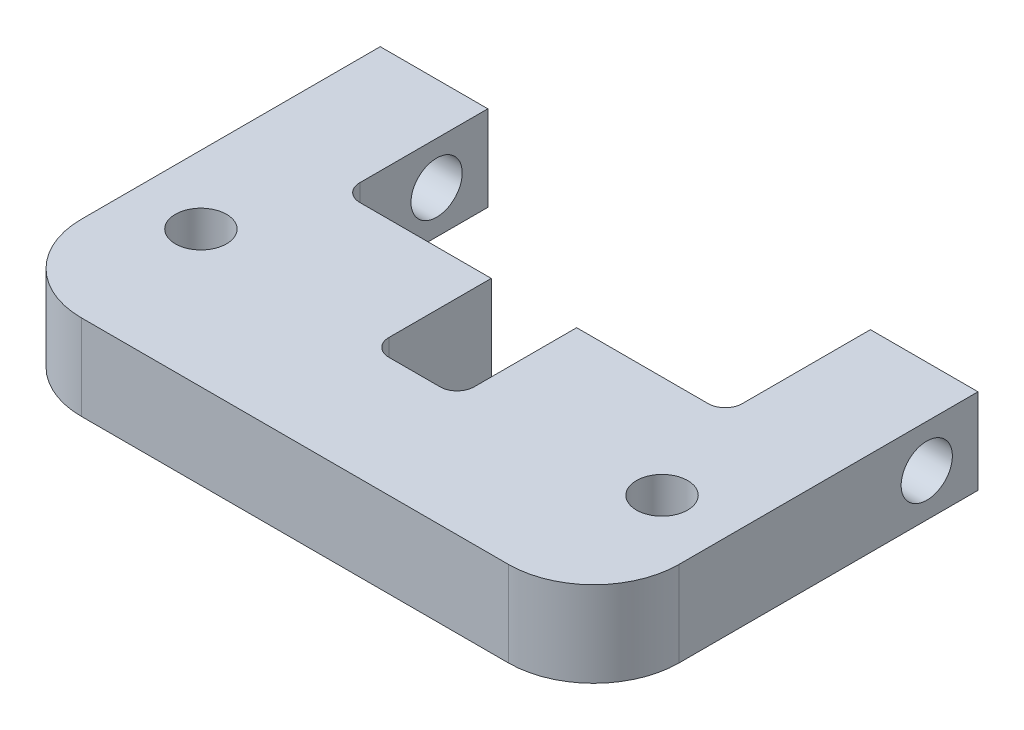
ISO-10303-21;
HEADER;
FILE_DESCRIPTION(('STEP AP214'),'2;1');
FILE_NAME('part.step','',(''),(''),'','','');
FILE_SCHEMA(('AUTOMOTIVE_DESIGN { 1 0 10303 214 1 1 1 1 }'));
ENDSEC;
DATA;
#1=APPLICATION_CONTEXT('core data for automotive mechanical design processes');
#2=APPLICATION_PROTOCOL_DEFINITION('international standard','automotive_design',2000,#1);
#3=PRODUCT_CONTEXT('',#1,'mechanical');
#4=PRODUCT('Part','Part','',(#3));
#5=PRODUCT_RELATED_PRODUCT_CATEGORY('part','',(#4));
#6=PRODUCT_DEFINITION_FORMATION('','',#4);
#7=PRODUCT_DEFINITION_CONTEXT('part definition',#1,'design');
#8=PRODUCT_DEFINITION('design','',#6,#7);
#9=PRODUCT_DEFINITION_SHAPE('','',#8);
#10=(LENGTH_UNIT() NAMED_UNIT(*) SI_UNIT(.MILLI.,.METRE.));
#11=(NAMED_UNIT(*) PLANE_ANGLE_UNIT() SI_UNIT($,.RADIAN.));
#12=(NAMED_UNIT(*) SI_UNIT($,.STERADIAN.) SOLID_ANGLE_UNIT());
#13=UNCERTAINTY_MEASURE_WITH_UNIT(LENGTH_MEASURE(1.E-05),#10,'distance_accuracy_value','');
#14=(GEOMETRIC_REPRESENTATION_CONTEXT(3) GLOBAL_UNCERTAINTY_ASSIGNED_CONTEXT((#13)) GLOBAL_UNIT_ASSIGNED_CONTEXT((#10,
#11,#12)) REPRESENTATION_CONTEXT('',''));
#15=CARTESIAN_POINT('',(0.,0.,0.));
#16=DIRECTION('',(0.,0.,1.));
#17=DIRECTION('',(1.,0.,0.));
#18=AXIS2_PLACEMENT_3D('',#15,#16,#17);
#19=CARTESIAN_POINT('',(10.2,5.,7.49999999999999));
#20=DIRECTION('',(0.,-1.,0.));
#21=DIRECTION('',(0.,0.,-1.));
#22=AXIS2_PLACEMENT_3D('',#19,#20,#21);
#23=PLANE('',#22);
#24=CARTESIAN_POINT('',(13.5,5.,14.5));
#25=DIRECTION('',(0.,1.,0.));
#26=DIRECTION('',(0.,0.,1.));
#27=AXIS2_PLACEMENT_3D('',#24,#25,#26);
#28=CIRCLE('',#27,1.5);
#29=CARTESIAN_POINT('',(13.5,5.,16.));
#30=VERTEX_POINT('',#29);
#31=EDGE_CURVE('E215',#30,#30,#28,.T.);
#32=ORIENTED_EDGE('',*,*,#31,.F.);
#33=EDGE_LOOP('',(#32));
#34=FACE_BOUND('',#33,.T.);
#35=DIRECTION('',(1.,0.,0.));
#36=VECTOR('',#35,1.);
#37=CARTESIAN_POINT('',(-17.5,5.,22.5));
#38=LINE('',#37,#36);
#39=CARTESIAN_POINT('',(-12.5,5.,22.5));
#40=VERTEX_POINT('',#39);
#41=CARTESIAN_POINT('',(12.5,5.,22.5));
#42=VERTEX_POINT('',#41);
#43=EDGE_CURVE('E169',#40,#42,#38,.T.);
#44=ORIENTED_EDGE('',*,*,#43,.T.);
#45=CARTESIAN_POINT('',(12.5,5.,17.5));
#46=DIRECTION('',(0.,-1.,0.));
#47=DIRECTION('',(0.,0.,-1.));
#48=AXIS2_PLACEMENT_3D('',#45,#46,#47);
#49=CIRCLE('',#48,5.);
#50=CARTESIAN_POINT('',(17.5,5.,17.5));
#51=VERTEX_POINT('',#50);
#52=EDGE_CURVE('E41',#42,#51,#49,.F.);
#53=ORIENTED_EDGE('',*,*,#52,.T.);
#54=DIRECTION('',(0.,0.,-1.));
#55=VECTOR('',#54,1.);
#56=CARTESIAN_POINT('',(17.5,5.,0.));
#57=LINE('',#56,#55);
#58=CARTESIAN_POINT('',(17.5,5.,0.));
#59=VERTEX_POINT('',#58);
#60=EDGE_CURVE('E159',#51,#59,#57,.T.);
#61=ORIENTED_EDGE('',*,*,#60,.T.);
#62=DIRECTION('',(-1.,0.,0.));
#63=VECTOR('',#62,1.);
#64=CARTESIAN_POINT('',(11.2,5.,0.));
#65=LINE('',#64,#63);
#66=CARTESIAN_POINT('',(11.2,5.,0.));
#67=VERTEX_POINT('',#66);
#68=EDGE_CURVE('E163',#59,#67,#65,.T.);
#69=ORIENTED_EDGE('',*,*,#68,.T.);
#70=DIRECTION('',(0.,0.,1.));
#71=VECTOR('',#70,1.);
#72=CARTESIAN_POINT('',(11.2,5.,0.));
#73=LINE('',#72,#71);
#74=CARTESIAN_POINT('',(11.2,5.,7.49999999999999));
#75=VERTEX_POINT('',#74);
#76=EDGE_CURVE('E184',#67,#75,#73,.T.);
#77=ORIENTED_EDGE('',*,*,#76,.T.);
#78=CARTESIAN_POINT('',(10.2,5.,7.49999999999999));
#79=DIRECTION('',(0.,-1.,0.));
#80=DIRECTION('',(0.,0.,-1.));
#81=AXIS2_PLACEMENT_3D('',#78,#79,#80);
#82=CIRCLE('',#81,0.999999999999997);
#83=CARTESIAN_POINT('',(10.2,5.,8.5));
#84=VERTEX_POINT('',#83);
#85=EDGE_CURVE('E186',#75,#84,#82,.T.);
#86=ORIENTED_EDGE('',*,*,#85,.T.);
#87=DIRECTION('',(-1.,0.,0.));
#88=VECTOR('',#87,1.);
#89=CARTESIAN_POINT('',(2.5,5.,8.5));
#90=LINE('',#89,#88);
#91=CARTESIAN_POINT('',(2.5,5.,8.5));
#92=VERTEX_POINT('',#91);
#93=EDGE_CURVE('E191',#84,#92,#90,.T.);
#94=ORIENTED_EDGE('',*,*,#93,.T.);
#95=DIRECTION('',(0.,0.,1.));
#96=VECTOR('',#95,1.);
#97=CARTESIAN_POINT('',(2.5,5.,8.5));
#98=LINE('',#97,#96);
#99=CARTESIAN_POINT('',(2.50000000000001,5.,14.5));
#100=VERTEX_POINT('',#99);
#101=EDGE_CURVE('E193',#92,#100,#98,.T.);
#102=ORIENTED_EDGE('',*,*,#101,.T.);
#103=CARTESIAN_POINT('',(1.50000000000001,5.,14.5));
#104=DIRECTION('',(0.,-1.,0.));
#105=DIRECTION('',(0.,0.,-1.));
#106=AXIS2_PLACEMENT_3D('',#103,#104,#105);
#107=CIRCLE('',#106,0.999999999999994);
#108=CARTESIAN_POINT('',(1.50000000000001,5.,15.5));
#109=VERTEX_POINT('',#108);
#110=EDGE_CURVE('E195',#100,#109,#107,.T.);
#111=ORIENTED_EDGE('',*,*,#110,.T.);
#112=DIRECTION('',(-1.,0.,0.));
#113=VECTOR('',#112,1.);
#114=CARTESIAN_POINT('',(-1.5,5.,15.5));
#115=LINE('',#114,#113);
#116=CARTESIAN_POINT('',(-1.5,5.,15.5));
#117=VERTEX_POINT('',#116);
#118=EDGE_CURVE('E197',#109,#117,#115,.T.);
#119=ORIENTED_EDGE('',*,*,#118,.T.);
#120=CARTESIAN_POINT('',(-1.5,5.,14.5));
#121=DIRECTION('',(0.,-1.,0.));
#122=DIRECTION('',(0.,0.,1.));
#123=AXIS2_PLACEMENT_3D('',#120,#121,#122);
#124=CIRCLE('',#123,0.999999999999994);
#125=CARTESIAN_POINT('',(-2.49999999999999,5.,14.5));
#126=VERTEX_POINT('',#125);
#127=EDGE_CURVE('E199',#117,#126,#124,.T.);
#128=ORIENTED_EDGE('',*,*,#127,.T.);
#129=DIRECTION('',(0.,0.,-1.));
#130=VECTOR('',#129,1.);
#131=CARTESIAN_POINT('',(-2.49999999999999,5.,8.5));
#132=LINE('',#131,#130);
#133=CARTESIAN_POINT('',(-2.49999999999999,5.,8.5));
#134=VERTEX_POINT('',#133);
#135=EDGE_CURVE('E201',#126,#134,#132,.T.);
#136=ORIENTED_EDGE('',*,*,#135,.T.);
#137=DIRECTION('',(-1.,0.,0.));
#138=VECTOR('',#137,1.);
#139=CARTESIAN_POINT('',(-10.2,5.,8.5));
#140=LINE('',#139,#138);
#141=CARTESIAN_POINT('',(-10.2,5.,8.49999999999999));
#142=VERTEX_POINT('',#141);
#143=EDGE_CURVE('E203',#134,#142,#140,.T.);
#144=ORIENTED_EDGE('',*,*,#143,.T.);
#145=CARTESIAN_POINT('',(-10.2,5.,7.5));
#146=DIRECTION('',(0.,-1.,0.));
#147=DIRECTION('',(0.,0.,1.));
#148=AXIS2_PLACEMENT_3D('',#145,#146,#147);
#149=CIRCLE('',#148,0.999999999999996);
#150=CARTESIAN_POINT('',(-11.2,5.,7.5));
#151=VERTEX_POINT('',#150);
#152=EDGE_CURVE('E205',#142,#151,#149,.T.);
#153=ORIENTED_EDGE('',*,*,#152,.T.);
#154=DIRECTION('',(0.,0.,-1.));
#155=VECTOR('',#154,1.);
#156=CARTESIAN_POINT('',(-11.2,5.,0.));
#157=LINE('',#156,#155);
#158=CARTESIAN_POINT('',(-11.2,5.,0.));
#159=VERTEX_POINT('',#158);
#160=EDGE_CURVE('E207',#151,#159,#157,.T.);
#161=ORIENTED_EDGE('',*,*,#160,.T.);
#162=DIRECTION('',(-1.,0.,0.));
#163=VECTOR('',#162,1.);
#164=CARTESIAN_POINT('',(-17.5,5.,0.));
#165=LINE('',#164,#163);
#166=CARTESIAN_POINT('',(-17.5,5.,0.));
#167=VERTEX_POINT('',#166);
#168=EDGE_CURVE('E209',#159,#167,#165,.T.);
#169=ORIENTED_EDGE('',*,*,#168,.T.);
#170=DIRECTION('',(0.,0.,1.));
#171=VECTOR('',#170,1.);
#172=CARTESIAN_POINT('',(-17.5,5.,0.));
#173=LINE('',#172,#171);
#174=CARTESIAN_POINT('',(-17.5,5.,17.5));
#175=VERTEX_POINT('',#174);
#176=EDGE_CURVE('E244',#167,#175,#173,.T.);
#177=ORIENTED_EDGE('',*,*,#176,.T.);
#178=CARTESIAN_POINT('',(-12.5,5.,17.5));
#179=DIRECTION('',(0.,-1.,0.));
#180=DIRECTION('',(0.,0.,-1.));
#181=AXIS2_PLACEMENT_3D('',#178,#179,#180);
#182=CIRCLE('',#181,5.);
#183=EDGE_CURVE('E295',#175,#40,#182,.F.);
#184=ORIENTED_EDGE('',*,*,#183,.T.);
#185=EDGE_LOOP('',(#44,#53,#61,#69,#77,#86,#94,#102,#111,#119,#128,#136,#144,#153,#161,#169,
#177,#184));
#186=FACE_BOUND('',#185,.T.);
#187=CARTESIAN_POINT('',(-13.5,5.,14.5));
#188=DIRECTION('',(0.,1.,0.));
#189=DIRECTION('',(0.,0.,-1.));
#190=AXIS2_PLACEMENT_3D('',#187,#188,#189);
#191=CIRCLE('',#190,1.5);
#192=CARTESIAN_POINT('',(-13.5,5.,13.));
#193=VERTEX_POINT('',#192);
#194=EDGE_CURVE('E585',#193,#193,#191,.T.);
#195=ORIENTED_EDGE('',*,*,#194,.F.);
#196=EDGE_LOOP('',(#195));
#197=FACE_BOUND('',#196,.T.);
#198=ADVANCED_FACE('F33',(#34,#186,#197),#23,.F.);
#199=CARTESIAN_POINT('',(10.2,0.,7.49999999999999));
#200=DIRECTION('',(0.,-1.,0.));
#201=DIRECTION('',(0.,0.,-1.));
#202=AXIS2_PLACEMENT_3D('',#199,#200,#201);
#203=PLANE('',#202);
#204=CARTESIAN_POINT('',(13.5,0.,14.5));
#205=DIRECTION('',(0.,1.,0.));
#206=DIRECTION('',(0.,0.,1.));
#207=AXIS2_PLACEMENT_3D('',#204,#205,#206);
#208=CIRCLE('',#207,1.5);
#209=CARTESIAN_POINT('',(13.5,0.,16.));
#210=VERTEX_POINT('',#209);
#211=EDGE_CURVE('E588',#210,#210,#208,.T.);
#212=ORIENTED_EDGE('',*,*,#211,.T.);
#213=EDGE_LOOP('',(#212));
#214=FACE_BOUND('',#213,.T.);
#215=DIRECTION('',(0.,0.,-1.));
#216=VECTOR('',#215,1.);
#217=CARTESIAN_POINT('',(17.5,0.,0.));
#218=LINE('',#217,#216);
#219=CARTESIAN_POINT('',(17.5,0.,17.5));
#220=VERTEX_POINT('',#219);
#221=CARTESIAN_POINT('',(17.5,0.,0.));
#222=VERTEX_POINT('',#221);
#223=EDGE_CURVE('E175',#220,#222,#218,.T.);
#224=ORIENTED_EDGE('',*,*,#223,.F.);
#225=CARTESIAN_POINT('',(12.5,0.,17.5));
#226=DIRECTION('',(0.,-1.,0.));
#227=DIRECTION('',(0.,0.,-1.));
#228=AXIS2_PLACEMENT_3D('',#225,#226,#227);
#229=CIRCLE('',#228,5.);
#230=CARTESIAN_POINT('',(12.5,0.,22.5));
#231=VERTEX_POINT('',#230);
#232=EDGE_CURVE('E289',#220,#231,#229,.T.);
#233=ORIENTED_EDGE('',*,*,#232,.T.);
#234=DIRECTION('',(1.,0.,0.));
#235=VECTOR('',#234,1.);
#236=CARTESIAN_POINT('',(6.00000000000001,0.,22.5));
#237=LINE('',#236,#235);
#238=CARTESIAN_POINT('',(-12.5,0.,22.5));
#239=VERTEX_POINT('',#238);
#240=EDGE_CURVE('E214',#239,#231,#237,.T.);
#241=ORIENTED_EDGE('',*,*,#240,.F.);
#242=CARTESIAN_POINT('',(-12.5,0.,17.5));
#243=DIRECTION('',(0.,-1.,0.));
#244=DIRECTION('',(0.,0.,-1.));
#245=AXIS2_PLACEMENT_3D('',#242,#243,#244);
#246=CIRCLE('',#245,5.);
#247=CARTESIAN_POINT('',(-17.5,0.,17.5));
#248=VERTEX_POINT('',#247);
#249=EDGE_CURVE('E287',#239,#248,#246,.T.);
#250=ORIENTED_EDGE('',*,*,#249,.T.);
#251=DIRECTION('',(0.,0.,1.));
#252=VECTOR('',#251,1.);
#253=CARTESIAN_POINT('',(-17.5,0.,0.));
#254=LINE('',#253,#252);
#255=CARTESIAN_POINT('',(-17.5,0.,0.));
#256=VERTEX_POINT('',#255);
#257=EDGE_CURVE('E212',#256,#248,#254,.T.);
#258=ORIENTED_EDGE('',*,*,#257,.F.);
#259=DIRECTION('',(-1.,0.,0.));
#260=VECTOR('',#259,1.);
#261=CARTESIAN_POINT('',(-17.5,0.,0.));
#262=LINE('',#261,#260);
#263=CARTESIAN_POINT('',(-11.2,0.,0.));
#264=VERTEX_POINT('',#263);
#265=EDGE_CURVE('E242',#264,#256,#262,.T.);
#266=ORIENTED_EDGE('',*,*,#265,.F.);
#267=DIRECTION('',(0.,0.,-1.));
#268=VECTOR('',#267,1.);
#269=CARTESIAN_POINT('',(-11.2,0.,0.));
#270=LINE('',#269,#268);
#271=CARTESIAN_POINT('',(-11.2,0.,7.5));
#272=VERTEX_POINT('',#271);
#273=EDGE_CURVE('E240',#272,#264,#270,.T.);
#274=ORIENTED_EDGE('',*,*,#273,.F.);
#275=CARTESIAN_POINT('',(-10.2,0.,7.5));
#276=DIRECTION('',(0.,-1.,0.));
#277=DIRECTION('',(0.,0.,1.));
#278=AXIS2_PLACEMENT_3D('',#275,#276,#277);
#279=CIRCLE('',#278,0.999999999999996);
#280=CARTESIAN_POINT('',(-10.2,0.,8.49999999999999));
#281=VERTEX_POINT('',#280);
#282=EDGE_CURVE('E238',#281,#272,#279,.T.);
#283=ORIENTED_EDGE('',*,*,#282,.F.);
#284=DIRECTION('',(-1.,0.,0.));
#285=VECTOR('',#284,1.);
#286=CARTESIAN_POINT('',(-10.2,0.,8.5));
#287=LINE('',#286,#285);
#288=CARTESIAN_POINT('',(-2.49999999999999,0.,8.5));
#289=VERTEX_POINT('',#288);
#290=EDGE_CURVE('E236',#289,#281,#287,.T.);
#291=ORIENTED_EDGE('',*,*,#290,.F.);
#292=DIRECTION('',(0.,0.,-1.));
#293=VECTOR('',#292,1.);
#294=CARTESIAN_POINT('',(-2.49999999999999,0.,8.5));
#295=LINE('',#294,#293);
#296=CARTESIAN_POINT('',(-2.49999999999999,0.,14.5));
#297=VERTEX_POINT('',#296);
#298=EDGE_CURVE('E234',#297,#289,#295,.T.);
#299=ORIENTED_EDGE('',*,*,#298,.F.);
#300=CARTESIAN_POINT('',(-1.5,0.,14.5));
#301=DIRECTION('',(0.,-1.,0.));
#302=DIRECTION('',(0.,0.,1.));
#303=AXIS2_PLACEMENT_3D('',#300,#301,#302);
#304=CIRCLE('',#303,0.999999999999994);
#305=CARTESIAN_POINT('',(-1.5,0.,15.5));
#306=VERTEX_POINT('',#305);
#307=EDGE_CURVE('E232',#306,#297,#304,.T.);
#308=ORIENTED_EDGE('',*,*,#307,.F.);
#309=DIRECTION('',(-1.,0.,0.));
#310=VECTOR('',#309,1.);
#311=CARTESIAN_POINT('',(-1.5,0.,15.5));
#312=LINE('',#311,#310);
#313=CARTESIAN_POINT('',(1.50000000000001,0.,15.5));
#314=VERTEX_POINT('',#313);
#315=EDGE_CURVE('E230',#314,#306,#312,.T.);
#316=ORIENTED_EDGE('',*,*,#315,.F.);
#317=CARTESIAN_POINT('',(1.50000000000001,0.,14.5));
#318=DIRECTION('',(0.,-1.,0.));
#319=DIRECTION('',(0.,0.,-1.));
#320=AXIS2_PLACEMENT_3D('',#317,#318,#319);
#321=CIRCLE('',#320,0.999999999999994);
#322=CARTESIAN_POINT('',(2.50000000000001,0.,14.5));
#323=VERTEX_POINT('',#322);
#324=EDGE_CURVE('E228',#323,#314,#321,.T.);
#325=ORIENTED_EDGE('',*,*,#324,.F.);
#326=DIRECTION('',(0.,0.,1.));
#327=VECTOR('',#326,1.);
#328=CARTESIAN_POINT('',(2.5,0.,8.5));
#329=LINE('',#328,#327);
#330=CARTESIAN_POINT('',(2.5,0.,8.5));
#331=VERTEX_POINT('',#330);
#332=EDGE_CURVE('E226',#331,#323,#329,.T.);
#333=ORIENTED_EDGE('',*,*,#332,.F.);
#334=DIRECTION('',(-1.,0.,0.));
#335=VECTOR('',#334,1.);
#336=CARTESIAN_POINT('',(2.5,0.,8.5));
#337=LINE('',#336,#335);
#338=CARTESIAN_POINT('',(10.2,0.,8.5));
#339=VERTEX_POINT('',#338);
#340=EDGE_CURVE('E224',#339,#331,#337,.T.);
#341=ORIENTED_EDGE('',*,*,#340,.F.);
#342=CARTESIAN_POINT('',(10.2,0.,7.49999999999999));
#343=DIRECTION('',(0.,-1.,0.));
#344=DIRECTION('',(0.,0.,-1.));
#345=AXIS2_PLACEMENT_3D('',#342,#343,#344);
#346=CIRCLE('',#345,0.999999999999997);
#347=CARTESIAN_POINT('',(11.2,0.,7.49999999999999));
#348=VERTEX_POINT('',#347);
#349=EDGE_CURVE('E222',#348,#339,#346,.T.);
#350=ORIENTED_EDGE('',*,*,#349,.F.);
#351=DIRECTION('',(0.,0.,1.));
#352=VECTOR('',#351,1.);
#353=CARTESIAN_POINT('',(11.2,0.,0.));
#354=LINE('',#353,#352);
#355=CARTESIAN_POINT('',(11.2,0.,0.));
#356=VERTEX_POINT('',#355);
#357=EDGE_CURVE('E220',#356,#348,#354,.T.);
#358=ORIENTED_EDGE('',*,*,#357,.F.);
#359=DIRECTION('',(-1.,0.,0.));
#360=VECTOR('',#359,1.);
#361=CARTESIAN_POINT('',(11.2,0.,0.));
#362=LINE('',#361,#360);
#363=EDGE_CURVE('E218',#222,#356,#362,.T.);
#364=ORIENTED_EDGE('',*,*,#363,.F.);
#365=EDGE_LOOP('',(#224,#233,#241,#250,#258,#266,#274,#283,#291,#299,#308,#316,#325,#333,#341,
#350,#358,#364));
#366=FACE_BOUND('',#365,.T.);
#367=CARTESIAN_POINT('',(-13.5,0.,14.5));
#368=DIRECTION('',(0.,1.,0.));
#369=DIRECTION('',(0.,0.,-1.));
#370=AXIS2_PLACEMENT_3D('',#367,#368,#369);
#371=CIRCLE('',#370,1.5);
#372=CARTESIAN_POINT('',(-13.5,0.,13.));
#373=VERTEX_POINT('',#372);
#374=EDGE_CURVE('E584',#373,#373,#371,.T.);
#375=ORIENTED_EDGE('',*,*,#374,.T.);
#376=EDGE_LOOP('',(#375));
#377=FACE_BOUND('',#376,.T.);
#378=ADVANCED_FACE('F303',(#214,#366,#377),#203,.T.);
#379=CARTESIAN_POINT('',(-17.5,5.,0.));
#380=DIRECTION('',(1.,0.,0.));
#381=DIRECTION('',(0.,0.,-1.));
#382=AXIS2_PLACEMENT_3D('',#379,#380,#381);
#383=PLANE('',#382);
#384=CARTESIAN_POINT('',(-17.5,2.5,3.));
#385=DIRECTION('',(1.,0.,0.));
#386=DIRECTION('',(0.,0.,-1.));
#387=AXIS2_PLACEMENT_3D('',#384,#385,#386);
#388=CIRCLE('',#387,1.5);
#389=CARTESIAN_POINT('',(-17.5,2.5,1.5));
#390=VERTEX_POINT('',#389);
#391=EDGE_CURVE('E285',#390,#390,#388,.T.);
#392=ORIENTED_EDGE('',*,*,#391,.T.);
#393=EDGE_LOOP('',(#392));
#394=FACE_BOUND('',#393,.T.);
#395=ORIENTED_EDGE('',*,*,#257,.T.);
#396=DIRECTION('',(0.,-1.,0.));
#397=VECTOR('',#396,1.);
#398=CARTESIAN_POINT('',(-17.5,5.,17.5));
#399=LINE('',#398,#397);
#400=EDGE_CURVE('E11',#248,#175,#399,.F.);
#401=ORIENTED_EDGE('',*,*,#400,.T.);
#402=ORIENTED_EDGE('',*,*,#176,.F.);
#403=DIRECTION('',(0.,-1.,0.));
#404=VECTOR('',#403,1.);
#405=CARTESIAN_POINT('',(-17.5,5.,0.));
#406=LINE('',#405,#404);
#407=EDGE_CURVE('E211',#167,#256,#406,.T.);
#408=ORIENTED_EDGE('',*,*,#407,.T.);
#409=EDGE_LOOP('',(#395,#401,#402,#408));
#410=FACE_BOUND('',#409,.T.);
#411=ADVANCED_FACE('F306',(#394,#410),#383,.F.);
#412=CARTESIAN_POINT('',(6.00000000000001,5.,22.5));
#413=DIRECTION('',(0.,0.,-1.));
#414=DIRECTION('',(-1.,0.,0.));
#415=AXIS2_PLACEMENT_3D('',#412,#413,#414);
#416=PLANE('',#415);
#417=ORIENTED_EDGE('',*,*,#240,.T.);
#418=DIRECTION('',(0.,-1.,0.));
#419=VECTOR('',#418,1.);
#420=CARTESIAN_POINT('',(12.5,5.,22.5));
#421=LINE('',#420,#419);
#422=EDGE_CURVE('E54',#231,#42,#421,.F.);
#423=ORIENTED_EDGE('',*,*,#422,.T.);
#424=ORIENTED_EDGE('',*,*,#43,.F.);
#425=DIRECTION('',(0.,-1.,0.));
#426=VECTOR('',#425,1.);
#427=CARTESIAN_POINT('',(-12.5,5.,22.5));
#428=LINE('',#427,#426);
#429=EDGE_CURVE('E291',#40,#239,#428,.T.);
#430=ORIENTED_EDGE('',*,*,#429,.T.);
#431=EDGE_LOOP('',(#417,#423,#424,#430));
#432=FACE_BOUND('',#431,.T.);
#433=ADVANCED_FACE('F299',(#432),#416,.F.);
#434=CARTESIAN_POINT('',(17.5,5.,0.));
#435=DIRECTION('',(-1.,0.,0.));
#436=DIRECTION('',(0.,0.,1.));
#437=AXIS2_PLACEMENT_3D('',#434,#435,#436);
#438=PLANE('',#437);
#439=CARTESIAN_POINT('',(17.5,2.5,3.));
#440=DIRECTION('',(1.,0.,0.));
#441=DIRECTION('',(0.,0.,-1.));
#442=AXIS2_PLACEMENT_3D('',#439,#440,#441);
#443=CIRCLE('',#442,1.5);
#444=CARTESIAN_POINT('',(17.5,2.5,1.5));
#445=VERTEX_POINT('',#444);
#446=EDGE_CURVE('E578',#445,#445,#443,.T.);
#447=ORIENTED_EDGE('',*,*,#446,.F.);
#448=EDGE_LOOP('',(#447));
#449=FACE_BOUND('',#448,.T.);
#450=ORIENTED_EDGE('',*,*,#60,.F.);
#451=DIRECTION('',(0.,-1.,0.));
#452=VECTOR('',#451,1.);
#453=CARTESIAN_POINT('',(17.5,5.,17.5));
#454=LINE('',#453,#452);
#455=EDGE_CURVE('E178',#51,#220,#454,.T.);
#456=ORIENTED_EDGE('',*,*,#455,.T.);
#457=ORIENTED_EDGE('',*,*,#223,.T.);
#458=DIRECTION('',(0.,-1.,0.));
#459=VECTOR('',#458,1.);
#460=CARTESIAN_POINT('',(17.5,5.,0.));
#461=LINE('',#460,#459);
#462=EDGE_CURVE('E172',#59,#222,#461,.T.);
#463=ORIENTED_EDGE('',*,*,#462,.F.);
#464=EDGE_LOOP('',(#450,#456,#457,#463));
#465=FACE_BOUND('',#464,.T.);
#466=ADVANCED_FACE('F173',(#449,#465),#438,.F.);
#467=CARTESIAN_POINT('',(11.2,5.,0.));
#468=DIRECTION('',(0.,0.,1.));
#469=DIRECTION('',(1.,0.,0.));
#470=AXIS2_PLACEMENT_3D('',#467,#468,#469);
#471=PLANE('',#470);
#472=ORIENTED_EDGE('',*,*,#363,.T.);
#473=DIRECTION('',(0.,-1.,0.));
#474=VECTOR('',#473,1.);
#475=CARTESIAN_POINT('',(11.2,5.,0.));
#476=LINE('',#475,#474);
#477=EDGE_CURVE('E179',#67,#356,#476,.T.);
#478=ORIENTED_EDGE('',*,*,#477,.F.);
#479=ORIENTED_EDGE('',*,*,#68,.F.);
#480=ORIENTED_EDGE('',*,*,#462,.T.);
#481=EDGE_LOOP('',(#472,#478,#479,#480));
#482=FACE_BOUND('',#481,.T.);
#483=ADVANCED_FACE('F181',(#482),#471,.F.);
#484=CARTESIAN_POINT('',(11.2,5.,0.));
#485=DIRECTION('',(1.,0.,0.));
#486=DIRECTION('',(0.,0.,-1.));
#487=AXIS2_PLACEMENT_3D('',#484,#485,#486);
#488=PLANE('',#487);
#489=CARTESIAN_POINT('',(11.2,2.5,3.));
#490=DIRECTION('',(1.,0.,0.));
#491=DIRECTION('',(0.,0.,-1.));
#492=AXIS2_PLACEMENT_3D('',#489,#490,#491);
#493=CIRCLE('',#492,1.5);
#494=CARTESIAN_POINT('',(11.2,2.5,1.5));
#495=VERTEX_POINT('',#494);
#496=EDGE_CURVE('E284',#495,#495,#493,.T.);
#497=ORIENTED_EDGE('',*,*,#496,.T.);
#498=EDGE_LOOP('',(#497));
#499=FACE_BOUND('',#498,.T.);
#500=ORIENTED_EDGE('',*,*,#357,.T.);
#501=DIRECTION('',(0.,-1.,0.));
#502=VECTOR('',#501,1.);
#503=CARTESIAN_POINT('',(11.2,5.,7.49999999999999));
#504=LINE('',#503,#502);
#505=EDGE_CURVE('E277',#75,#348,#504,.T.);
#506=ORIENTED_EDGE('',*,*,#505,.F.);
#507=ORIENTED_EDGE('',*,*,#76,.F.);
#508=ORIENTED_EDGE('',*,*,#477,.T.);
#509=EDGE_LOOP('',(#500,#506,#507,#508));
#510=FACE_BOUND('',#509,.T.);
#511=ADVANCED_FACE('F364',(#499,#510),#488,.F.);
#512=CARTESIAN_POINT('',(10.2,5.,7.49999999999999));
#513=DIRECTION('',(0.,-1.,0.));
#514=DIRECTION('',(0.,0.,-1.));
#515=AXIS2_PLACEMENT_3D('',#512,#513,#514);
#516=CYLINDRICAL_SURFACE('',#515,0.999999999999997);
#517=ORIENTED_EDGE('',*,*,#349,.T.);
#518=DIRECTION('',(0.,-1.,0.));
#519=VECTOR('',#518,1.);
#520=CARTESIAN_POINT('',(10.2,5.,8.5));
#521=LINE('',#520,#519);
#522=EDGE_CURVE('E274',#84,#339,#521,.T.);
#523=ORIENTED_EDGE('',*,*,#522,.F.);
#524=ORIENTED_EDGE('',*,*,#85,.F.);
#525=ORIENTED_EDGE('',*,*,#505,.T.);
#526=EDGE_LOOP('',(#517,#523,#524,#525));
#527=FACE_BOUND('',#526,.T.);
#528=ADVANCED_FACE('F360',(#527),#516,.F.);
#529=CARTESIAN_POINT('',(2.5,5.,8.5));
#530=DIRECTION('',(0.,0.,1.));
#531=DIRECTION('',(1.,0.,0.));
#532=AXIS2_PLACEMENT_3D('',#529,#530,#531);
#533=PLANE('',#532);
#534=ORIENTED_EDGE('',*,*,#340,.T.);
#535=DIRECTION('',(0.,-1.,0.));
#536=VECTOR('',#535,1.);
#537=CARTESIAN_POINT('',(2.5,5.,8.5));
#538=LINE('',#537,#536);
#539=EDGE_CURVE('E271',#92,#331,#538,.T.);
#540=ORIENTED_EDGE('',*,*,#539,.F.);
#541=ORIENTED_EDGE('',*,*,#93,.F.);
#542=ORIENTED_EDGE('',*,*,#522,.T.);
#543=EDGE_LOOP('',(#534,#540,#541,#542));
#544=FACE_BOUND('',#543,.T.);
#545=ADVANCED_FACE('F355',(#544),#533,.F.);
#546=CARTESIAN_POINT('',(2.5,5.,8.5));
#547=DIRECTION('',(1.,0.,0.));
#548=DIRECTION('',(0.,0.,-1.));
#549=AXIS2_PLACEMENT_3D('',#546,#547,#548);
#550=PLANE('',#549);
#551=ORIENTED_EDGE('',*,*,#332,.T.);
#552=DIRECTION('',(0.,-1.,0.));
#553=VECTOR('',#552,1.);
#554=CARTESIAN_POINT('',(2.50000000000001,5.,14.5));
#555=LINE('',#554,#553);
#556=EDGE_CURVE('E268',#100,#323,#555,.T.);
#557=ORIENTED_EDGE('',*,*,#556,.F.);
#558=ORIENTED_EDGE('',*,*,#101,.F.);
#559=ORIENTED_EDGE('',*,*,#539,.T.);
#560=EDGE_LOOP('',(#551,#557,#558,#559));
#561=FACE_BOUND('',#560,.T.);
#562=ADVANCED_FACE('F351',(#561),#550,.F.);
#563=CARTESIAN_POINT('',(1.50000000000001,5.,14.5));
#564=DIRECTION('',(0.,-1.,0.));
#565=DIRECTION('',(0.,0.,-1.));
#566=AXIS2_PLACEMENT_3D('',#563,#564,#565);
#567=CYLINDRICAL_SURFACE('',#566,0.999999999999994);
#568=ORIENTED_EDGE('',*,*,#324,.T.);
#569=DIRECTION('',(0.,-1.,0.));
#570=VECTOR('',#569,1.);
#571=CARTESIAN_POINT('',(1.50000000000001,5.,15.5));
#572=LINE('',#571,#570);
#573=EDGE_CURVE('E265',#109,#314,#572,.T.);
#574=ORIENTED_EDGE('',*,*,#573,.F.);
#575=ORIENTED_EDGE('',*,*,#110,.F.);
#576=ORIENTED_EDGE('',*,*,#556,.T.);
#577=EDGE_LOOP('',(#568,#574,#575,#576));
#578=FACE_BOUND('',#577,.T.);
#579=ADVANCED_FACE('F346',(#578),#567,.F.);
#580=CARTESIAN_POINT('',(-1.5,5.,15.5));
#581=DIRECTION('',(0.,0.,1.));
#582=DIRECTION('',(1.,0.,0.));
#583=AXIS2_PLACEMENT_3D('',#580,#581,#582);
#584=PLANE('',#583);
#585=ORIENTED_EDGE('',*,*,#315,.T.);
#586=DIRECTION('',(0.,-1.,0.));
#587=VECTOR('',#586,1.);
#588=CARTESIAN_POINT('',(-1.5,5.,15.5));
#589=LINE('',#588,#587);
#590=EDGE_CURVE('E262',#117,#306,#589,.T.);
#591=ORIENTED_EDGE('',*,*,#590,.F.);
#592=ORIENTED_EDGE('',*,*,#118,.F.);
#593=ORIENTED_EDGE('',*,*,#573,.T.);
#594=EDGE_LOOP('',(#585,#591,#592,#593));
#595=FACE_BOUND('',#594,.T.);
#596=ADVANCED_FACE('F340',(#595),#584,.F.);
#597=CARTESIAN_POINT('',(-1.5,5.,14.5));
#598=DIRECTION('',(0.,-1.,0.));
#599=DIRECTION('',(0.,0.,-1.));
#600=AXIS2_PLACEMENT_3D('',#597,#598,#599);
#601=CYLINDRICAL_SURFACE('',#600,0.999999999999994);
#602=ORIENTED_EDGE('',*,*,#307,.T.);
#603=DIRECTION('',(0.,-1.,0.));
#604=VECTOR('',#603,1.);
#605=CARTESIAN_POINT('',(-2.49999999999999,5.,14.5));
#606=LINE('',#605,#604);
#607=EDGE_CURVE('E259',#126,#297,#606,.T.);
#608=ORIENTED_EDGE('',*,*,#607,.F.);
#609=ORIENTED_EDGE('',*,*,#127,.F.);
#610=ORIENTED_EDGE('',*,*,#590,.T.);
#611=EDGE_LOOP('',(#602,#608,#609,#610));
#612=FACE_BOUND('',#611,.T.);
#613=ADVANCED_FACE('F336',(#612),#601,.F.);
#614=CARTESIAN_POINT('',(-2.49999999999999,5.,8.5));
#615=DIRECTION('',(-1.,0.,0.));
#616=DIRECTION('',(0.,0.,1.));
#617=AXIS2_PLACEMENT_3D('',#614,#615,#616);
#618=PLANE('',#617);
#619=ORIENTED_EDGE('',*,*,#298,.T.);
#620=DIRECTION('',(0.,-1.,0.));
#621=VECTOR('',#620,1.);
#622=CARTESIAN_POINT('',(-2.49999999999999,5.,8.5));
#623=LINE('',#622,#621);
#624=EDGE_CURVE('E256',#134,#289,#623,.T.);
#625=ORIENTED_EDGE('',*,*,#624,.F.);
#626=ORIENTED_EDGE('',*,*,#135,.F.);
#627=ORIENTED_EDGE('',*,*,#607,.T.);
#628=EDGE_LOOP('',(#619,#625,#626,#627));
#629=FACE_BOUND('',#628,.T.);
#630=ADVANCED_FACE('F331',(#629),#618,.F.);
#631=CARTESIAN_POINT('',(-10.2,5.,8.5));
#632=DIRECTION('',(0.,0.,1.));
#633=DIRECTION('',(1.,0.,0.));
#634=AXIS2_PLACEMENT_3D('',#631,#632,#633);
#635=PLANE('',#634);
#636=ORIENTED_EDGE('',*,*,#290,.T.);
#637=DIRECTION('',(0.,-1.,0.));
#638=VECTOR('',#637,1.);
#639=CARTESIAN_POINT('',(-10.2,5.,8.49999999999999));
#640=LINE('',#639,#638);
#641=EDGE_CURVE('E253',#142,#281,#640,.T.);
#642=ORIENTED_EDGE('',*,*,#641,.F.);
#643=ORIENTED_EDGE('',*,*,#143,.F.);
#644=ORIENTED_EDGE('',*,*,#624,.T.);
#645=EDGE_LOOP('',(#636,#642,#643,#644));
#646=FACE_BOUND('',#645,.T.);
#647=ADVANCED_FACE('F325',(#646),#635,.F.);
#648=CARTESIAN_POINT('',(-10.2,5.,7.5));
#649=DIRECTION('',(0.,-1.,0.));
#650=DIRECTION('',(0.,0.,-1.));
#651=AXIS2_PLACEMENT_3D('',#648,#649,#650);
#652=CYLINDRICAL_SURFACE('',#651,0.999999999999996);
#653=ORIENTED_EDGE('',*,*,#282,.T.);
#654=DIRECTION('',(0.,-1.,0.));
#655=VECTOR('',#654,1.);
#656=CARTESIAN_POINT('',(-11.2,5.,7.5));
#657=LINE('',#656,#655);
#658=EDGE_CURVE('E250',#151,#272,#657,.T.);
#659=ORIENTED_EDGE('',*,*,#658,.F.);
#660=ORIENTED_EDGE('',*,*,#152,.F.);
#661=ORIENTED_EDGE('',*,*,#641,.T.);
#662=EDGE_LOOP('',(#653,#659,#660,#661));
#663=FACE_BOUND('',#662,.T.);
#664=ADVANCED_FACE('F321',(#663),#652,.F.);
#665=CARTESIAN_POINT('',(-11.2,5.,0.));
#666=DIRECTION('',(-1.,0.,0.));
#667=DIRECTION('',(0.,0.,1.));
#668=AXIS2_PLACEMENT_3D('',#665,#666,#667);
#669=PLANE('',#668);
#670=CARTESIAN_POINT('',(-11.2,2.5,3.));
#671=DIRECTION('',(-1.,0.,0.));
#672=DIRECTION('',(0.,0.,1.));
#673=AXIS2_PLACEMENT_3D('',#670,#671,#672);
#674=CIRCLE('',#673,1.5);
#675=CARTESIAN_POINT('',(-11.2,2.5,4.5));
#676=VERTEX_POINT('',#675);
#677=EDGE_CURVE('E281',#676,#676,#674,.T.);
#678=ORIENTED_EDGE('',*,*,#677,.T.);
#679=EDGE_LOOP('',(#678));
#680=FACE_BOUND('',#679,.T.);
#681=ORIENTED_EDGE('',*,*,#273,.T.);
#682=DIRECTION('',(0.,-1.,0.));
#683=VECTOR('',#682,1.);
#684=CARTESIAN_POINT('',(-11.2,5.,0.));
#685=LINE('',#684,#683);
#686=EDGE_CURVE('E247',#159,#264,#685,.T.);
#687=ORIENTED_EDGE('',*,*,#686,.F.);
#688=ORIENTED_EDGE('',*,*,#160,.F.);
#689=ORIENTED_EDGE('',*,*,#658,.T.);
#690=EDGE_LOOP('',(#681,#687,#688,#689));
#691=FACE_BOUND('',#690,.T.);
#692=ADVANCED_FACE('F316',(#680,#691),#669,.F.);
#693=CARTESIAN_POINT('',(-17.5,5.,0.));
#694=DIRECTION('',(0.,0.,1.));
#695=DIRECTION('',(1.,0.,0.));
#696=AXIS2_PLACEMENT_3D('',#693,#694,#695);
#697=PLANE('',#696);
#698=ORIENTED_EDGE('',*,*,#265,.T.);
#699=ORIENTED_EDGE('',*,*,#407,.F.);
#700=ORIENTED_EDGE('',*,*,#168,.F.);
#701=ORIENTED_EDGE('',*,*,#686,.T.);
#702=EDGE_LOOP('',(#698,#699,#700,#701));
#703=FACE_BOUND('',#702,.T.);
#704=ADVANCED_FACE('F310',(#703),#697,.F.);
#705=CARTESIAN_POINT('',(13.5,5.,14.5));
#706=DIRECTION('',(0.,-1.,0.));
#707=DIRECTION('',(0.,0.,-1.));
#708=AXIS2_PLACEMENT_3D('',#705,#706,#707);
#709=CYLINDRICAL_SURFACE('',#708,1.5);
#710=ORIENTED_EDGE('',*,*,#31,.T.);
#711=EDGE_LOOP('',(#710));
#712=FACE_BOUND('',#711,.T.);
#713=ORIENTED_EDGE('',*,*,#211,.F.);
#714=EDGE_LOOP('',(#713));
#715=FACE_BOUND('',#714,.T.);
#716=ADVANCED_FACE('F385',(#712,#715),#709,.F.);
#717=CARTESIAN_POINT('',(-13.5,5.,14.5));
#718=DIRECTION('',(0.,-1.,0.));
#719=DIRECTION('',(0.,0.,-1.));
#720=AXIS2_PLACEMENT_3D('',#717,#718,#719);
#721=CYLINDRICAL_SURFACE('',#720,1.5);
#722=ORIENTED_EDGE('',*,*,#194,.T.);
#723=EDGE_LOOP('',(#722));
#724=FACE_BOUND('',#723,.T.);
#725=ORIENTED_EDGE('',*,*,#374,.F.);
#726=EDGE_LOOP('',(#725));
#727=FACE_BOUND('',#726,.T.);
#728=ADVANCED_FACE('F455',(#724,#727),#721,.F.);
#729=CARTESIAN_POINT('',(-17.5,2.5,3.));
#730=DIRECTION('',(1.,0.,0.));
#731=DIRECTION('',(0.,0.,-1.));
#732=AXIS2_PLACEMENT_3D('',#729,#730,#731);
#733=CYLINDRICAL_SURFACE('',#732,1.5);
#734=ORIENTED_EDGE('',*,*,#391,.F.);
#735=EDGE_LOOP('',(#734));
#736=FACE_BOUND('',#735,.T.);
#737=ORIENTED_EDGE('',*,*,#677,.F.);
#738=EDGE_LOOP('',(#737));
#739=FACE_BOUND('',#738,.T.);
#740=ADVANCED_FACE('F462',(#736,#739),#733,.F.);
#741=ORIENTED_EDGE('',*,*,#446,.T.);
#742=EDGE_LOOP('',(#741));
#743=FACE_BOUND('',#742,.T.);
#744=ORIENTED_EDGE('',*,*,#496,.F.);
#745=EDGE_LOOP('',(#744));
#746=FACE_BOUND('',#745,.T.);
#747=ADVANCED_FACE('F468',(#743,#746),#733,.F.);
#748=CARTESIAN_POINT('',(12.5,5.,17.5));
#749=DIRECTION('',(0.,-1.,0.));
#750=DIRECTION('',(0.,0.,-1.));
#751=AXIS2_PLACEMENT_3D('',#748,#749,#750);
#752=CYLINDRICAL_SURFACE('',#751,5.);
#753=ORIENTED_EDGE('',*,*,#52,.F.);
#754=ORIENTED_EDGE('',*,*,#422,.F.);
#755=ORIENTED_EDGE('',*,*,#232,.F.);
#756=ORIENTED_EDGE('',*,*,#455,.F.);
#757=EDGE_LOOP('',(#753,#754,#755,#756));
#758=FACE_BOUND('',#757,.T.);
#759=ADVANCED_FACE('F476',(#758),#752,.T.);
#760=CARTESIAN_POINT('',(-12.5,5.,17.5));
#761=DIRECTION('',(0.,-1.,0.));
#762=DIRECTION('',(0.,0.,-1.));
#763=AXIS2_PLACEMENT_3D('',#760,#761,#762);
#764=CYLINDRICAL_SURFACE('',#763,5.);
#765=ORIENTED_EDGE('',*,*,#183,.F.);
#766=ORIENTED_EDGE('',*,*,#400,.F.);
#767=ORIENTED_EDGE('',*,*,#249,.F.);
#768=ORIENTED_EDGE('',*,*,#429,.F.);
#769=EDGE_LOOP('',(#765,#766,#767,#768));
#770=FACE_BOUND('',#769,.T.);
#771=ADVANCED_FACE('F35',(#770),#764,.T.);
#772=CLOSED_SHELL('',(#198,#378,#411,#433,#466,#483,#511,#528,#545,#562,#579,#596,#613,#630,
#647,#664,#692,#704,#716,#728,#740,#747,#759,#771));
#773=MANIFOLD_SOLID_BREP('B2',#772);
#774=ADVANCED_BREP_SHAPE_REPRESENTATION('',(#18,#773),#14);
#775=SHAPE_DEFINITION_REPRESENTATION(#9,#774);
ENDSEC;
END-ISO-10303-21;
